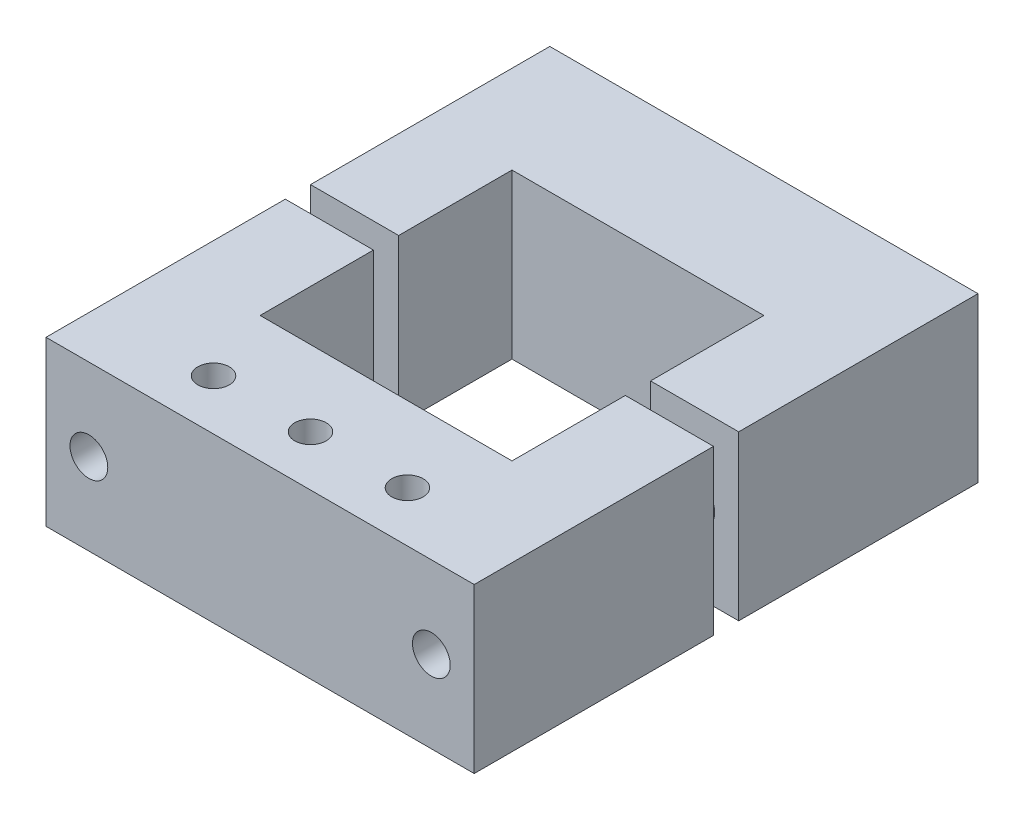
ISO-10303-21;
HEADER;
FILE_DESCRIPTION(('STEP AP214'),'2;1');
FILE_NAME('part.step','',(''),(''),'','','');
FILE_SCHEMA(('AUTOMOTIVE_DESIGN { 1 0 10303 214 1 1 1 1 }'));
ENDSEC;
DATA;
#1=APPLICATION_CONTEXT('core data for automotive mechanical design processes');
#2=APPLICATION_PROTOCOL_DEFINITION('international standard','automotive_design',2000,#1);
#3=PRODUCT_CONTEXT('',#1,'mechanical');
#4=PRODUCT('Part','Part','',(#3));
#5=PRODUCT_RELATED_PRODUCT_CATEGORY('part','',(#4));
#6=PRODUCT_DEFINITION_FORMATION('','',#4);
#7=PRODUCT_DEFINITION_CONTEXT('part definition',#1,'design');
#8=PRODUCT_DEFINITION('design','',#6,#7);
#9=PRODUCT_DEFINITION_SHAPE('','',#8);
#10=(LENGTH_UNIT() NAMED_UNIT(*) SI_UNIT(.MILLI.,.METRE.));
#11=(NAMED_UNIT(*) PLANE_ANGLE_UNIT() SI_UNIT($,.RADIAN.));
#12=(NAMED_UNIT(*) SI_UNIT($,.STERADIAN.) SOLID_ANGLE_UNIT());
#13=UNCERTAINTY_MEASURE_WITH_UNIT(LENGTH_MEASURE(1.E-05),#10,'distance_accuracy_value','');
#14=(GEOMETRIC_REPRESENTATION_CONTEXT(3) GLOBAL_UNCERTAINTY_ASSIGNED_CONTEXT((#13)) GLOBAL_UNIT_ASSIGNED_CONTEXT((#10,
#11,#12)) REPRESENTATION_CONTEXT('',''));
#15=CARTESIAN_POINT('',(0.,0.,0.));
#16=DIRECTION('',(0.,0.,1.));
#17=DIRECTION('',(1.,0.,0.));
#18=AXIS2_PLACEMENT_3D('',#15,#16,#17);
#19=CARTESIAN_POINT('',(244.342156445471,-136.058532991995,-30.));
#20=DIRECTION('',(1.,0.,0.));
#21=DIRECTION('',(0.,0.,-1.));
#22=AXIS2_PLACEMENT_3D('',#19,#20,#21);
#23=PLANE('',#22);
#24=DIRECTION('',(0.,1.,0.));
#25=VECTOR('',#24,1.);
#26=CARTESIAN_POINT('',(244.342156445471,-156.058532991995,-11.));
#27=LINE('',#26,#25);
#28=CARTESIAN_POINT('',(244.342156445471,-149.058532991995,-11.));
#29=VERTEX_POINT('',#28);
#30=CARTESIAN_POINT('',(244.342156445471,-136.058532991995,-11.));
#31=VERTEX_POINT('',#30);
#32=EDGE_CURVE('E165',#29,#31,#27,.T.);
#33=ORIENTED_EDGE('',*,*,#32,.F.);
#34=DIRECTION('',(0.,0.,1.));
#35=VECTOR('',#34,1.);
#36=CARTESIAN_POINT('',(244.342156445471,-149.058532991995,-30.));
#37=LINE('',#36,#35);
#38=CARTESIAN_POINT('',(244.342156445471,-149.058532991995,-30.));
#39=VERTEX_POINT('',#38);
#40=EDGE_CURVE('E139',#39,#29,#37,.T.);
#41=ORIENTED_EDGE('',*,*,#40,.F.);
#42=DIRECTION('',(0.,1.,0.));
#43=VECTOR('',#42,1.);
#44=CARTESIAN_POINT('',(244.342156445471,-136.058532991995,-30.));
#45=LINE('',#44,#43);
#46=CARTESIAN_POINT('',(244.342156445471,-136.058532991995,-30.));
#47=VERTEX_POINT('',#46);
#48=EDGE_CURVE('E138',#39,#47,#45,.T.);
#49=ORIENTED_EDGE('',*,*,#48,.T.);
#50=DIRECTION('',(0.,0.,1.));
#51=VECTOR('',#50,1.);
#52=CARTESIAN_POINT('',(244.342156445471,-136.058532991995,-30.));
#53=LINE('',#52,#51);
#54=EDGE_CURVE('E135',#47,#31,#53,.T.);
#55=ORIENTED_EDGE('',*,*,#54,.T.);
#56=EDGE_LOOP('',(#33,#41,#49,#55));
#57=FACE_BOUND('',#56,.T.);
#58=ADVANCED_FACE('F42',(#57),#23,.T.);
#59=CARTESIAN_POINT('',(240.938339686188,-142.558532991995,-30.));
#60=DIRECTION('',(0.,0.,1.));
#61=DIRECTION('',(1.,0.,0.));
#62=AXIS2_PLACEMENT_3D('',#59,#60,#61);
#63=CYLINDRICAL_SURFACE('',#62,1.5);
#64=CARTESIAN_POINT('',(240.938339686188,-142.558532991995,-11.));
#65=DIRECTION('',(0.,0.,-1.));
#66=DIRECTION('',(-1.,0.,0.));
#67=AXIS2_PLACEMENT_3D('',#64,#65,#66);
#68=CIRCLE('',#67,1.5);
#69=CARTESIAN_POINT('',(239.438339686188,-142.558532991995,-11.));
#70=VERTEX_POINT('',#69);
#71=EDGE_CURVE('E137',#70,#70,#68,.F.);
#72=ORIENTED_EDGE('',*,*,#71,.T.);
#73=EDGE_LOOP('',(#72));
#74=FACE_BOUND('',#73,.T.);
#75=CARTESIAN_POINT('',(240.938339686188,-142.558532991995,-30.));
#76=DIRECTION('',(0.,0.,1.));
#77=DIRECTION('',(-1.,0.,0.));
#78=AXIS2_PLACEMENT_3D('',#75,#76,#77);
#79=CIRCLE('',#78,1.5);
#80=CARTESIAN_POINT('',(239.438339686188,-142.558532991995,-30.));
#81=VERTEX_POINT('',#80);
#82=EDGE_CURVE('E141',#81,#81,#79,.T.);
#83=ORIENTED_EDGE('',*,*,#82,.F.);
#84=EDGE_LOOP('',(#83));
#85=FACE_BOUND('',#84,.T.);
#86=ADVANCED_FACE('F44',(#74,#85),#63,.F.);
#87=CARTESIAN_POINT('',(210.342156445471,-149.058532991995,-30.));
#88=DIRECTION('',(-1.,0.,0.));
#89=DIRECTION('',(0.,0.,1.));
#90=AXIS2_PLACEMENT_3D('',#87,#88,#89);
#91=PLANE('',#90);
#92=DIRECTION('',(0.,1.,0.));
#93=VECTOR('',#92,1.);
#94=CARTESIAN_POINT('',(210.342156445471,-156.058532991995,-11.));
#95=LINE('',#94,#93);
#96=CARTESIAN_POINT('',(210.342156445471,-149.058532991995,-11.));
#97=VERTEX_POINT('',#96);
#98=CARTESIAN_POINT('',(210.342156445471,-136.058532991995,-11.));
#99=VERTEX_POINT('',#98);
#100=EDGE_CURVE('E156',#97,#99,#95,.T.);
#101=ORIENTED_EDGE('',*,*,#100,.T.);
#102=DIRECTION('',(0.,0.,1.));
#103=VECTOR('',#102,1.);
#104=CARTESIAN_POINT('',(210.342156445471,-136.058532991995,-30.));
#105=LINE('',#104,#103);
#106=CARTESIAN_POINT('',(210.342156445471,-136.058532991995,-30.));
#107=VERTEX_POINT('',#106);
#108=EDGE_CURVE('E131',#107,#99,#105,.T.);
#109=ORIENTED_EDGE('',*,*,#108,.F.);
#110=DIRECTION('',(0.,-1.,0.));
#111=VECTOR('',#110,1.);
#112=CARTESIAN_POINT('',(210.342156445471,-149.058532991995,-30.));
#113=LINE('',#112,#111);
#114=CARTESIAN_POINT('',(210.342156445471,-149.058532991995,-30.));
#115=VERTEX_POINT('',#114);
#116=EDGE_CURVE('E153',#107,#115,#113,.T.);
#117=ORIENTED_EDGE('',*,*,#116,.T.);
#118=DIRECTION('',(0.,0.,1.));
#119=VECTOR('',#118,1.);
#120=CARTESIAN_POINT('',(210.342156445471,-149.058532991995,-30.));
#121=LINE('',#120,#119);
#122=EDGE_CURVE('E46',#115,#97,#121,.T.);
#123=ORIENTED_EDGE('',*,*,#122,.T.);
#124=EDGE_LOOP('',(#101,#109,#117,#123));
#125=FACE_BOUND('',#124,.T.);
#126=ADVANCED_FACE('F188',(#125),#91,.T.);
#127=CARTESIAN_POINT('',(210.342156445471,-136.058532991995,-30.));
#128=DIRECTION('',(0.,1.,0.));
#129=DIRECTION('',(0.,0.,1.));
#130=AXIS2_PLACEMENT_3D('',#127,#128,#129);
#131=PLANE('',#130);
#132=DIRECTION('',(-1.,0.,0.));
#133=VECTOR('',#132,1.);
#134=CARTESIAN_POINT('',(237.342156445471,-136.058532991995,-11.));
#135=LINE('',#134,#133);
#136=CARTESIAN_POINT('',(237.342156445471,-136.058532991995,-11.));
#137=VERTEX_POINT('',#136);
#138=EDGE_CURVE('E171',#31,#137,#135,.T.);
#139=ORIENTED_EDGE('',*,*,#138,.F.);
#140=ORIENTED_EDGE('',*,*,#54,.F.);
#141=DIRECTION('',(-1.,0.,0.));
#142=VECTOR('',#141,1.);
#143=CARTESIAN_POINT('',(210.342156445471,-136.058532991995,-30.));
#144=LINE('',#143,#142);
#145=EDGE_CURVE('E134',#47,#107,#144,.T.);
#146=ORIENTED_EDGE('',*,*,#145,.T.);
#147=ORIENTED_EDGE('',*,*,#108,.T.);
#148=DIRECTION('',(-1.,0.,0.));
#149=VECTOR('',#148,1.);
#150=CARTESIAN_POINT('',(217.342156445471,-136.058532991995,-11.));
#151=LINE('',#150,#149);
#152=CARTESIAN_POINT('',(217.342156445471,-136.058532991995,-11.));
#153=VERTEX_POINT('',#152);
#154=EDGE_CURVE('E121',#153,#99,#151,.T.);
#155=ORIENTED_EDGE('',*,*,#154,.F.);
#156=DIRECTION('',(0.,0.,1.));
#157=VECTOR('',#156,1.);
#158=CARTESIAN_POINT('',(217.342156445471,-136.058532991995,-20.));
#159=LINE('',#158,#157);
#160=CARTESIAN_POINT('',(217.342156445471,-136.058532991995,-20.));
#161=VERTEX_POINT('',#160);
#162=EDGE_CURVE('E106',#161,#153,#159,.T.);
#163=ORIENTED_EDGE('',*,*,#162,.F.);
#164=DIRECTION('',(-1.,0.,0.));
#165=VECTOR('',#164,1.);
#166=CARTESIAN_POINT('',(237.342156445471,-136.058532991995,-20.));
#167=LINE('',#166,#165);
#168=CARTESIAN_POINT('',(237.342156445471,-136.058532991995,-20.));
#169=VERTEX_POINT('',#168);
#170=EDGE_CURVE('E12',#169,#161,#167,.T.);
#171=ORIENTED_EDGE('',*,*,#170,.F.);
#172=DIRECTION('',(0.,0.,-1.));
#173=VECTOR('',#172,1.);
#174=CARTESIAN_POINT('',(237.342156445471,-136.058532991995,-11.));
#175=LINE('',#174,#173);
#176=EDGE_CURVE('E128',#137,#169,#175,.T.);
#177=ORIENTED_EDGE('',*,*,#176,.F.);
#178=EDGE_LOOP('',(#139,#140,#146,#147,#155,#163,#171,#177));
#179=FACE_BOUND('',#178,.T.);
#180=ADVANCED_FACE('F119',(#179),#131,.T.);
#181=CARTESIAN_POINT('',(244.342156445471,-149.058532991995,-30.));
#182=DIRECTION('',(0.,-1.,0.));
#183=DIRECTION('',(0.,0.,-1.));
#184=AXIS2_PLACEMENT_3D('',#181,#182,#183);
#185=PLANE('',#184);
#186=DIRECTION('',(1.,0.,0.));
#187=VECTOR('',#186,1.);
#188=CARTESIAN_POINT('',(244.342156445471,-149.058532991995,-11.));
#189=LINE('',#188,#187);
#190=CARTESIAN_POINT('',(237.342156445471,-149.058532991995,-11.));
#191=VERTEX_POINT('',#190);
#192=EDGE_CURVE('E163',#191,#29,#189,.T.);
#193=ORIENTED_EDGE('',*,*,#192,.F.);
#194=DIRECTION('',(0.,0.,1.));
#195=VECTOR('',#194,1.);
#196=CARTESIAN_POINT('',(237.342156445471,-149.058532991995,-30.));
#197=LINE('',#196,#195);
#198=CARTESIAN_POINT('',(237.342156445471,-149.058532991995,-20.));
#199=VERTEX_POINT('',#198);
#200=EDGE_CURVE('E172',#199,#191,#197,.T.);
#201=ORIENTED_EDGE('',*,*,#200,.F.);
#202=DIRECTION('',(1.,0.,0.));
#203=VECTOR('',#202,1.);
#204=CARTESIAN_POINT('',(244.342156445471,-149.058532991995,-20.));
#205=LINE('',#204,#203);
#206=CARTESIAN_POINT('',(217.342156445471,-149.058532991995,-20.));
#207=VERTEX_POINT('',#206);
#208=EDGE_CURVE('E122',#207,#199,#205,.T.);
#209=ORIENTED_EDGE('',*,*,#208,.F.);
#210=DIRECTION('',(0.,0.,-1.));
#211=VECTOR('',#210,1.);
#212=CARTESIAN_POINT('',(217.342156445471,-149.058532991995,-30.));
#213=LINE('',#212,#211);
#214=CARTESIAN_POINT('',(217.342156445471,-149.058532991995,-11.));
#215=VERTEX_POINT('',#214);
#216=EDGE_CURVE('E109',#215,#207,#213,.T.);
#217=ORIENTED_EDGE('',*,*,#216,.F.);
#218=DIRECTION('',(1.,0.,0.));
#219=VECTOR('',#218,1.);
#220=CARTESIAN_POINT('',(244.342156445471,-149.058532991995,-11.));
#221=LINE('',#220,#219);
#222=EDGE_CURVE('E160',#97,#215,#221,.T.);
#223=ORIENTED_EDGE('',*,*,#222,.F.);
#224=ORIENTED_EDGE('',*,*,#122,.F.);
#225=DIRECTION('',(1.,0.,0.));
#226=VECTOR('',#225,1.);
#227=CARTESIAN_POINT('',(244.342156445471,-149.058532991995,-30.));
#228=LINE('',#227,#226);
#229=EDGE_CURVE('E133',#115,#39,#228,.T.);
#230=ORIENTED_EDGE('',*,*,#229,.T.);
#231=ORIENTED_EDGE('',*,*,#40,.T.);
#232=EDGE_LOOP('',(#193,#201,#209,#217,#223,#224,#230,#231));
#233=FACE_BOUND('',#232,.T.);
#234=ADVANCED_FACE('F191',(#233),#185,.T.);
#235=CARTESIAN_POINT('',(210.342156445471,-136.058532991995,-30.));
#236=DIRECTION('',(0.,0.,-1.));
#237=DIRECTION('',(-1.,0.,0.));
#238=AXIS2_PLACEMENT_3D('',#235,#236,#237);
#239=PLANE('',#238);
#240=ORIENTED_EDGE('',*,*,#82,.T.);
#241=EDGE_LOOP('',(#240));
#242=FACE_BOUND('',#241,.T.);
#243=CARTESIAN_POINT('',(213.745973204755,-142.558532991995,-30.));
#244=DIRECTION('',(0.,0.,1.));
#245=DIRECTION('',(1.,0.,0.));
#246=AXIS2_PLACEMENT_3D('',#243,#244,#245);
#247=CIRCLE('',#246,1.5);
#248=CARTESIAN_POINT('',(215.245973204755,-142.558532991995,-30.));
#249=VERTEX_POINT('',#248);
#250=EDGE_CURVE('E146',#249,#249,#247,.T.);
#251=ORIENTED_EDGE('',*,*,#250,.T.);
#252=EDGE_LOOP('',(#251));
#253=FACE_BOUND('',#252,.T.);
#254=ORIENTED_EDGE('',*,*,#116,.F.);
#255=ORIENTED_EDGE('',*,*,#145,.F.);
#256=ORIENTED_EDGE('',*,*,#48,.F.);
#257=ORIENTED_EDGE('',*,*,#229,.F.);
#258=EDGE_LOOP('',(#254,#255,#256,#257));
#259=FACE_BOUND('',#258,.T.);
#260=ADVANCED_FACE('F194',(#242,#253,#259),#239,.T.);
#261=CARTESIAN_POINT('',(213.745973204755,-142.558532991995,-30.));
#262=DIRECTION('',(0.,0.,1.));
#263=DIRECTION('',(1.,0.,0.));
#264=AXIS2_PLACEMENT_3D('',#261,#262,#263);
#265=CYLINDRICAL_SURFACE('',#264,1.5);
#266=CARTESIAN_POINT('',(213.745973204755,-142.558532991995,-11.));
#267=DIRECTION('',(0.,0.,-1.));
#268=DIRECTION('',(-1.,0.,0.));
#269=AXIS2_PLACEMENT_3D('',#266,#267,#268);
#270=CIRCLE('',#269,1.5);
#271=CARTESIAN_POINT('',(212.245973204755,-142.558532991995,-11.));
#272=VERTEX_POINT('',#271);
#273=EDGE_CURVE('E158',#272,#272,#270,.F.);
#274=ORIENTED_EDGE('',*,*,#273,.T.);
#275=EDGE_LOOP('',(#274));
#276=FACE_BOUND('',#275,.T.);
#277=ORIENTED_EDGE('',*,*,#250,.F.);
#278=EDGE_LOOP('',(#277));
#279=FACE_BOUND('',#278,.T.);
#280=ADVANCED_FACE('F223',(#276,#279),#265,.F.);
#281=CARTESIAN_POINT('',(217.342156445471,-156.058532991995,-11.));
#282=DIRECTION('',(0.,0.,-1.));
#283=DIRECTION('',(-1.,0.,0.));
#284=AXIS2_PLACEMENT_3D('',#281,#282,#283);
#285=PLANE('',#284);
#286=ORIENTED_EDGE('',*,*,#222,.T.);
#287=DIRECTION('',(0.,1.,0.));
#288=VECTOR('',#287,1.);
#289=CARTESIAN_POINT('',(217.342156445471,-156.058532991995,-11.));
#290=LINE('',#289,#288);
#291=EDGE_CURVE('E162',#215,#153,#290,.T.);
#292=ORIENTED_EDGE('',*,*,#291,.T.);
#293=ORIENTED_EDGE('',*,*,#154,.T.);
#294=ORIENTED_EDGE('',*,*,#100,.F.);
#295=EDGE_LOOP('',(#286,#292,#293,#294));
#296=FACE_BOUND('',#295,.T.);
#297=ORIENTED_EDGE('',*,*,#273,.F.);
#298=EDGE_LOOP('',(#297));
#299=FACE_BOUND('',#298,.T.);
#300=ADVANCED_FACE('F208',(#296,#299),#285,.F.);
#301=CARTESIAN_POINT('',(237.342156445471,-156.058532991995,-11.));
#302=DIRECTION('',(0.,0.,-1.));
#303=DIRECTION('',(-1.,0.,0.));
#304=AXIS2_PLACEMENT_3D('',#301,#302,#303);
#305=PLANE('',#304);
#306=ORIENTED_EDGE('',*,*,#192,.T.);
#307=ORIENTED_EDGE('',*,*,#32,.T.);
#308=ORIENTED_EDGE('',*,*,#138,.T.);
#309=DIRECTION('',(0.,1.,0.));
#310=VECTOR('',#309,1.);
#311=CARTESIAN_POINT('',(237.342156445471,-156.058532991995,-11.));
#312=LINE('',#311,#310);
#313=EDGE_CURVE('E130',#191,#137,#312,.T.);
#314=ORIENTED_EDGE('',*,*,#313,.F.);
#315=EDGE_LOOP('',(#306,#307,#308,#314));
#316=FACE_BOUND('',#315,.T.);
#317=ORIENTED_EDGE('',*,*,#71,.F.);
#318=EDGE_LOOP('',(#317));
#319=FACE_BOUND('',#318,.T.);
#320=ADVANCED_FACE('F198',(#316,#319),#305,.F.);
#321=CARTESIAN_POINT('',(237.342156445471,-156.058532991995,-11.));
#322=DIRECTION('',(1.,0.,0.));
#323=DIRECTION('',(0.,0.,-1.));
#324=AXIS2_PLACEMENT_3D('',#321,#322,#323);
#325=PLANE('',#324);
#326=ORIENTED_EDGE('',*,*,#200,.T.);
#327=ORIENTED_EDGE('',*,*,#313,.T.);
#328=ORIENTED_EDGE('',*,*,#176,.T.);
#329=DIRECTION('',(0.,1.,0.));
#330=VECTOR('',#329,1.);
#331=CARTESIAN_POINT('',(237.342156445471,-156.058532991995,-20.));
#332=LINE('',#331,#330);
#333=EDGE_CURVE('E52',#199,#169,#332,.T.);
#334=ORIENTED_EDGE('',*,*,#333,.F.);
#335=EDGE_LOOP('',(#326,#327,#328,#334));
#336=FACE_BOUND('',#335,.T.);
#337=ADVANCED_FACE('F200',(#336),#325,.F.);
#338=CARTESIAN_POINT('',(217.342156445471,-156.058532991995,-20.));
#339=DIRECTION('',(-1.,0.,0.));
#340=DIRECTION('',(0.,0.,1.));
#341=AXIS2_PLACEMENT_3D('',#338,#339,#340);
#342=PLANE('',#341);
#343=ORIENTED_EDGE('',*,*,#216,.T.);
#344=DIRECTION('',(0.,1.,0.));
#345=VECTOR('',#344,1.);
#346=CARTESIAN_POINT('',(217.342156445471,-156.058532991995,-20.));
#347=LINE('',#346,#345);
#348=EDGE_CURVE('E59',#207,#161,#347,.T.);
#349=ORIENTED_EDGE('',*,*,#348,.T.);
#350=ORIENTED_EDGE('',*,*,#162,.T.);
#351=ORIENTED_EDGE('',*,*,#291,.F.);
#352=EDGE_LOOP('',(#343,#349,#350,#351));
#353=FACE_BOUND('',#352,.T.);
#354=ADVANCED_FACE('F103',(#353),#342,.F.);
#355=CARTESIAN_POINT('',(237.342156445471,-156.058532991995,-20.));
#356=DIRECTION('',(0.,0.,-1.));
#357=DIRECTION('',(-1.,0.,0.));
#358=AXIS2_PLACEMENT_3D('',#355,#356,#357);
#359=PLANE('',#358);
#360=ORIENTED_EDGE('',*,*,#208,.T.);
#361=ORIENTED_EDGE('',*,*,#333,.T.);
#362=ORIENTED_EDGE('',*,*,#170,.T.);
#363=ORIENTED_EDGE('',*,*,#348,.F.);
#364=EDGE_LOOP('',(#360,#361,#362,#363));
#365=FACE_BOUND('',#364,.T.);
#366=ADVANCED_FACE('F113',(#365),#359,.F.);
#367=CLOSED_SHELL('',(#58,#86,#126,#180,#234,#260,#280,#300,#320,#337,#354,#366));
#368=MANIFOLD_SOLID_BREP('B2',#367);
#369=CARTESIAN_POINT('',(244.342156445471,-149.058532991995,-30.));
#370=DIRECTION('',(0.,-1.,0.));
#371=DIRECTION('',(0.,0.,-1.));
#372=AXIS2_PLACEMENT_3D('',#369,#370,#371);
#373=PLANE('',#372);
#374=CARTESIAN_POINT('',(219.644215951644,-149.058532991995,5.99999999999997));
#375=DIRECTION('',(0.,-1.,0.));
#376=DIRECTION('',(0.,0.,-1.));
#377=AXIS2_PLACEMENT_3D('',#374,#375,#376);
#378=CIRCLE('',#377,1.25000000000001);
#379=CARTESIAN_POINT('',(219.644215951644,-149.058532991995,4.74999999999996));
#380=VERTEX_POINT('',#379);
#381=EDGE_CURVE('E484',#380,#380,#378,.T.);
#382=ORIENTED_EDGE('',*,*,#381,.F.);
#383=EDGE_LOOP('',(#382));
#384=FACE_BOUND('',#383,.T.);
#385=CARTESIAN_POINT('',(227.342156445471,-149.058532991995,5.99999999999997));
#386=DIRECTION('',(0.,-1.,0.));
#387=DIRECTION('',(0.,0.,-1.));
#388=AXIS2_PLACEMENT_3D('',#385,#386,#387);
#389=CIRCLE('',#388,1.25000000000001);
#390=CARTESIAN_POINT('',(227.342156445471,-149.058532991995,4.74999999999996));
#391=VERTEX_POINT('',#390);
#392=EDGE_CURVE('E478',#391,#391,#389,.T.);
#393=ORIENTED_EDGE('',*,*,#392,.F.);
#394=EDGE_LOOP('',(#393));
#395=FACE_BOUND('',#394,.T.);
#396=CARTESIAN_POINT('',(235.040096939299,-149.058532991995,6.00000000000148));
#397=DIRECTION('',(0.,-1.,0.));
#398=DIRECTION('',(0.,0.,-1.));
#399=AXIS2_PLACEMENT_3D('',#396,#397,#398);
#400=CIRCLE('',#399,1.25000000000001);
#401=CARTESIAN_POINT('',(235.040096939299,-149.058532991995,4.75000000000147));
#402=VERTEX_POINT('',#401);
#403=EDGE_CURVE('E391',#402,#402,#400,.T.);
#404=ORIENTED_EDGE('',*,*,#403,.F.);
#405=EDGE_LOOP('',(#404));
#406=FACE_BOUND('',#405,.T.);
#407=DIRECTION('',(-1.,0.,0.));
#408=VECTOR('',#407,1.);
#409=CARTESIAN_POINT('',(244.342156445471,-149.058532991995,-9.00000000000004));
#410=LINE('',#409,#408);
#411=CARTESIAN_POINT('',(244.342156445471,-149.058532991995,-9.00000000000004));
#412=VERTEX_POINT('',#411);
#413=CARTESIAN_POINT('',(237.342156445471,-149.058532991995,-9.00000000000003));
#414=VERTEX_POINT('',#413);
#415=EDGE_CURVE('E412',#412,#414,#410,.T.);
#416=ORIENTED_EDGE('',*,*,#415,.F.);
#417=DIRECTION('',(0.,0.,1.));
#418=VECTOR('',#417,1.);
#419=CARTESIAN_POINT('',(244.342156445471,-149.058532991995,-30.));
#420=LINE('',#419,#418);
#421=CARTESIAN_POINT('',(244.342156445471,-149.058532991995,10.));
#422=VERTEX_POINT('',#421);
#423=EDGE_CURVE('E400',#412,#422,#420,.T.);
#424=ORIENTED_EDGE('',*,*,#423,.T.);
#425=DIRECTION('',(1.,0.,0.));
#426=VECTOR('',#425,1.);
#427=CARTESIAN_POINT('',(244.342156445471,-149.058532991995,10.));
#428=LINE('',#427,#426);
#429=CARTESIAN_POINT('',(210.342156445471,-149.058532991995,10.));
#430=VERTEX_POINT('',#429);
#431=EDGE_CURVE('E442',#430,#422,#428,.T.);
#432=ORIENTED_EDGE('',*,*,#431,.F.);
#433=DIRECTION('',(0.,0.,1.));
#434=VECTOR('',#433,1.);
#435=CARTESIAN_POINT('',(210.342156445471,-149.058532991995,-30.));
#436=LINE('',#435,#434);
#437=CARTESIAN_POINT('',(210.342156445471,-149.058532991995,-9.00000000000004));
#438=VERTEX_POINT('',#437);
#439=EDGE_CURVE('E407',#438,#430,#436,.T.);
#440=ORIENTED_EDGE('',*,*,#439,.F.);
#441=DIRECTION('',(-1.,0.,0.));
#442=VECTOR('',#441,1.);
#443=CARTESIAN_POINT('',(244.342156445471,-149.058532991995,-9.00000000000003));
#444=LINE('',#443,#442);
#445=CARTESIAN_POINT('',(217.342156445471,-149.058532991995,-9.00000000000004));
#446=VERTEX_POINT('',#445);
#447=EDGE_CURVE('E381',#446,#438,#444,.T.);
#448=ORIENTED_EDGE('',*,*,#447,.F.);
#449=DIRECTION('',(0.,0.,-1.));
#450=VECTOR('',#449,1.);
#451=CARTESIAN_POINT('',(217.342156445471,-149.058532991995,-30.));
#452=LINE('',#451,#450);
#453=CARTESIAN_POINT('',(217.342156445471,-149.058532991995,0.));
#454=VERTEX_POINT('',#453);
#455=EDGE_CURVE('E396',#454,#446,#452,.T.);
#456=ORIENTED_EDGE('',*,*,#455,.F.);
#457=DIRECTION('',(-1.,0.,0.));
#458=VECTOR('',#457,1.);
#459=CARTESIAN_POINT('',(244.342156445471,-149.058532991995,0.));
#460=LINE('',#459,#458);
#461=CARTESIAN_POINT('',(237.342156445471,-149.058532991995,0.));
#462=VERTEX_POINT('',#461);
#463=EDGE_CURVE('E319',#462,#454,#460,.T.);
#464=ORIENTED_EDGE('',*,*,#463,.F.);
#465=DIRECTION('',(0.,0.,1.));
#466=VECTOR('',#465,1.);
#467=CARTESIAN_POINT('',(237.342156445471,-149.058532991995,-30.));
#468=LINE('',#467,#466);
#469=EDGE_CURVE('E40',#414,#462,#468,.T.);
#470=ORIENTED_EDGE('',*,*,#469,.F.);
#471=EDGE_LOOP('',(#416,#424,#432,#440,#448,#456,#464,#470));
#472=FACE_BOUND('',#471,.T.);
#473=ADVANCED_FACE('F311',(#384,#395,#406,#472),#373,.T.);
#474=CARTESIAN_POINT('',(244.342156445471,-136.058532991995,-30.));
#475=DIRECTION('',(1.,0.,0.));
#476=DIRECTION('',(0.,0.,-1.));
#477=AXIS2_PLACEMENT_3D('',#474,#475,#476);
#478=PLANE('',#477);
#479=DIRECTION('',(0.,1.,0.));
#480=VECTOR('',#479,1.);
#481=CARTESIAN_POINT('',(244.342156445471,-156.058532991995,-9.00000000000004));
#482=LINE('',#481,#480);
#483=CARTESIAN_POINT('',(244.342156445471,-136.058532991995,-9.00000000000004));
#484=VERTEX_POINT('',#483);
#485=EDGE_CURVE('E413',#412,#484,#482,.T.);
#486=ORIENTED_EDGE('',*,*,#485,.T.);
#487=DIRECTION('',(0.,0.,1.));
#488=VECTOR('',#487,1.);
#489=CARTESIAN_POINT('',(244.342156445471,-136.058532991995,-30.));
#490=LINE('',#489,#488);
#491=CARTESIAN_POINT('',(244.342156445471,-136.058532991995,10.));
#492=VERTEX_POINT('',#491);
#493=EDGE_CURVE('E397',#484,#492,#490,.T.);
#494=ORIENTED_EDGE('',*,*,#493,.T.);
#495=DIRECTION('',(0.,1.,0.));
#496=VECTOR('',#495,1.);
#497=CARTESIAN_POINT('',(244.342156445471,-136.058532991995,10.));
#498=LINE('',#497,#496);
#499=EDGE_CURVE('E444',#422,#492,#498,.T.);
#500=ORIENTED_EDGE('',*,*,#499,.F.);
#501=ORIENTED_EDGE('',*,*,#423,.F.);
#502=EDGE_LOOP('',(#486,#494,#500,#501));
#503=FACE_BOUND('',#502,.T.);
#504=ADVANCED_FACE('F454',(#503),#478,.T.);
#505=CARTESIAN_POINT('',(210.342156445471,-136.058532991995,-30.));
#506=DIRECTION('',(0.,1.,0.));
#507=DIRECTION('',(0.,0.,1.));
#508=AXIS2_PLACEMENT_3D('',#505,#506,#507);
#509=PLANE('',#508);
#510=CARTESIAN_POINT('',(219.644215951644,-136.058532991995,5.99999999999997));
#511=DIRECTION('',(0.,1.,0.));
#512=DIRECTION('',(0.,0.,1.));
#513=AXIS2_PLACEMENT_3D('',#510,#511,#512);
#514=CIRCLE('',#513,1.25000000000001);
#515=CARTESIAN_POINT('',(219.644215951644,-136.058532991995,7.24999999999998));
#516=VERTEX_POINT('',#515);
#517=EDGE_CURVE('E487',#516,#516,#514,.T.);
#518=ORIENTED_EDGE('',*,*,#517,.F.);
#519=EDGE_LOOP('',(#518));
#520=FACE_BOUND('',#519,.T.);
#521=CARTESIAN_POINT('',(227.342156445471,-136.058532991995,5.99999999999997));
#522=DIRECTION('',(0.,1.,0.));
#523=DIRECTION('',(0.,0.,1.));
#524=AXIS2_PLACEMENT_3D('',#521,#522,#523);
#525=CIRCLE('',#524,1.25000000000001);
#526=CARTESIAN_POINT('',(227.342156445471,-136.058532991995,7.24999999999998));
#527=VERTEX_POINT('',#526);
#528=EDGE_CURVE('E481',#527,#527,#525,.T.);
#529=ORIENTED_EDGE('',*,*,#528,.F.);
#530=EDGE_LOOP('',(#529));
#531=FACE_BOUND('',#530,.T.);
#532=CARTESIAN_POINT('',(235.040096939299,-136.058532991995,6.00000000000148));
#533=DIRECTION('',(0.,1.,0.));
#534=DIRECTION('',(0.,0.,1.));
#535=AXIS2_PLACEMENT_3D('',#532,#533,#534);
#536=CIRCLE('',#535,1.25000000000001);
#537=CARTESIAN_POINT('',(235.040096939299,-136.058532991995,7.25000000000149));
#538=VERTEX_POINT('',#537);
#539=EDGE_CURVE('E475',#538,#538,#536,.T.);
#540=ORIENTED_EDGE('',*,*,#539,.F.);
#541=EDGE_LOOP('',(#540));
#542=FACE_BOUND('',#541,.T.);
#543=DIRECTION('',(1.,0.,0.));
#544=VECTOR('',#543,1.);
#545=CARTESIAN_POINT('',(244.342156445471,-136.058532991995,-9.00000000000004));
#546=LINE('',#545,#544);
#547=CARTESIAN_POINT('',(237.342156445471,-136.058532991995,-9.00000000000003));
#548=VERTEX_POINT('',#547);
#549=EDGE_CURVE('E384',#548,#484,#546,.T.);
#550=ORIENTED_EDGE('',*,*,#549,.F.);
#551=DIRECTION('',(0.,0.,-1.));
#552=VECTOR('',#551,1.);
#553=CARTESIAN_POINT('',(237.342156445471,-136.058532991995,0.));
#554=LINE('',#553,#552);
#555=CARTESIAN_POINT('',(237.342156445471,-136.058532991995,0.));
#556=VERTEX_POINT('',#555);
#557=EDGE_CURVE('E468',#556,#548,#554,.T.);
#558=ORIENTED_EDGE('',*,*,#557,.F.);
#559=DIRECTION('',(1.,0.,0.));
#560=VECTOR('',#559,1.);
#561=CARTESIAN_POINT('',(217.342156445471,-136.058532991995,0.));
#562=LINE('',#561,#560);
#563=CARTESIAN_POINT('',(217.342156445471,-136.058532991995,0.));
#564=VERTEX_POINT('',#563);
#565=EDGE_CURVE('E469',#564,#556,#562,.T.);
#566=ORIENTED_EDGE('',*,*,#565,.F.);
#567=DIRECTION('',(0.,0.,1.));
#568=VECTOR('',#567,1.);
#569=CARTESIAN_POINT('',(217.342156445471,-136.058532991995,-9.00000000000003));
#570=LINE('',#569,#568);
#571=CARTESIAN_POINT('',(217.342156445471,-136.058532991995,-9.00000000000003));
#572=VERTEX_POINT('',#571);
#573=EDGE_CURVE('E390',#572,#564,#570,.T.);
#574=ORIENTED_EDGE('',*,*,#573,.F.);
#575=DIRECTION('',(1.,0.,0.));
#576=VECTOR('',#575,1.);
#577=CARTESIAN_POINT('',(210.342156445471,-136.058532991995,-9.00000000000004));
#578=LINE('',#577,#576);
#579=CARTESIAN_POINT('',(210.342156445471,-136.058532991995,-9.00000000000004));
#580=VERTEX_POINT('',#579);
#581=EDGE_CURVE('E378',#580,#572,#578,.T.);
#582=ORIENTED_EDGE('',*,*,#581,.F.);
#583=DIRECTION('',(0.,0.,1.));
#584=VECTOR('',#583,1.);
#585=CARTESIAN_POINT('',(210.342156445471,-136.058532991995,-30.));
#586=LINE('',#585,#584);
#587=CARTESIAN_POINT('',(210.342156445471,-136.058532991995,10.));
#588=VERTEX_POINT('',#587);
#589=EDGE_CURVE('E334',#580,#588,#586,.T.);
#590=ORIENTED_EDGE('',*,*,#589,.T.);
#591=DIRECTION('',(-1.,0.,0.));
#592=VECTOR('',#591,1.);
#593=CARTESIAN_POINT('',(210.342156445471,-136.058532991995,10.));
#594=LINE('',#593,#592);
#595=EDGE_CURVE('E403',#492,#588,#594,.T.);
#596=ORIENTED_EDGE('',*,*,#595,.F.);
#597=ORIENTED_EDGE('',*,*,#493,.F.);
#598=EDGE_LOOP('',(#550,#558,#566,#574,#582,#590,#596,#597));
#599=FACE_BOUND('',#598,.T.);
#600=ADVANCED_FACE('F387',(#520,#531,#542,#599),#509,.T.);
#601=CARTESIAN_POINT('',(210.342156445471,-149.058532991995,-30.));
#602=DIRECTION('',(-1.,0.,0.));
#603=DIRECTION('',(0.,0.,1.));
#604=AXIS2_PLACEMENT_3D('',#601,#602,#603);
#605=PLANE('',#604);
#606=DIRECTION('',(0.,1.,0.));
#607=VECTOR('',#606,1.);
#608=CARTESIAN_POINT('',(210.342156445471,-156.058532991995,-9.00000000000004));
#609=LINE('',#608,#607);
#610=EDGE_CURVE('E375',#438,#580,#609,.T.);
#611=ORIENTED_EDGE('',*,*,#610,.F.);
#612=ORIENTED_EDGE('',*,*,#439,.T.);
#613=DIRECTION('',(0.,-1.,0.));
#614=VECTOR('',#613,1.);
#615=CARTESIAN_POINT('',(210.342156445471,-149.058532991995,10.));
#616=LINE('',#615,#614);
#617=EDGE_CURVE('E395',#588,#430,#616,.T.);
#618=ORIENTED_EDGE('',*,*,#617,.F.);
#619=ORIENTED_EDGE('',*,*,#589,.F.);
#620=EDGE_LOOP('',(#611,#612,#618,#619));
#621=FACE_BOUND('',#620,.T.);
#622=ADVANCED_FACE('F313',(#621),#605,.T.);
#623=CARTESIAN_POINT('',(213.745973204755,-142.558532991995,-30.));
#624=DIRECTION('',(0.,0.,1.));
#625=DIRECTION('',(1.,0.,0.));
#626=AXIS2_PLACEMENT_3D('',#623,#624,#625);
#627=CYLINDRICAL_SURFACE('',#626,1.5);
#628=CARTESIAN_POINT('',(213.745973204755,-142.558532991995,-9.00000000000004));
#629=DIRECTION('',(0.,0.,1.));
#630=DIRECTION('',(1.,0.,0.));
#631=AXIS2_PLACEMENT_3D('',#628,#629,#630);
#632=CIRCLE('',#631,1.5);
#633=CARTESIAN_POINT('',(215.245973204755,-142.558532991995,-9.00000000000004));
#634=VERTEX_POINT('',#633);
#635=EDGE_CURVE('E414',#634,#634,#632,.F.);
#636=ORIENTED_EDGE('',*,*,#635,.T.);
#637=EDGE_LOOP('',(#636));
#638=FACE_BOUND('',#637,.T.);
#639=CARTESIAN_POINT('',(213.745973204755,-142.558532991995,10.));
#640=DIRECTION('',(0.,0.,1.));
#641=DIRECTION('',(1.,0.,0.));
#642=AXIS2_PLACEMENT_3D('',#639,#640,#641);
#643=CIRCLE('',#642,1.5);
#644=CARTESIAN_POINT('',(215.245973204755,-142.558532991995,10.));
#645=VERTEX_POINT('',#644);
#646=EDGE_CURVE('E435',#645,#645,#643,.T.);
#647=ORIENTED_EDGE('',*,*,#646,.T.);
#648=EDGE_LOOP('',(#647));
#649=FACE_BOUND('',#648,.T.);
#650=ADVANCED_FACE('F523',(#638,#649),#627,.F.);
#651=CARTESIAN_POINT('',(210.342156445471,-136.058532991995,10.));
#652=DIRECTION('',(0.,0.,-1.));
#653=DIRECTION('',(-1.,0.,0.));
#654=AXIS2_PLACEMENT_3D('',#651,#652,#653);
#655=PLANE('',#654);
#656=ORIENTED_EDGE('',*,*,#646,.F.);
#657=EDGE_LOOP('',(#656));
#658=FACE_BOUND('',#657,.T.);
#659=ORIENTED_EDGE('',*,*,#617,.T.);
#660=ORIENTED_EDGE('',*,*,#431,.T.);
#661=ORIENTED_EDGE('',*,*,#499,.T.);
#662=ORIENTED_EDGE('',*,*,#595,.T.);
#663=EDGE_LOOP('',(#659,#660,#661,#662));
#664=FACE_BOUND('',#663,.T.);
#665=CARTESIAN_POINT('',(240.938339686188,-142.558532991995,10.));
#666=DIRECTION('',(0.,0.,1.));
#667=DIRECTION('',(-1.,0.,0.));
#668=AXIS2_PLACEMENT_3D('',#665,#666,#667);
#669=CIRCLE('',#668,1.5);
#670=CARTESIAN_POINT('',(239.438339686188,-142.558532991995,10.));
#671=VERTEX_POINT('',#670);
#672=EDGE_CURVE('E432',#671,#671,#669,.T.);
#673=ORIENTED_EDGE('',*,*,#672,.F.);
#674=EDGE_LOOP('',(#673));
#675=FACE_BOUND('',#674,.T.);
#676=ADVANCED_FACE('F448',(#658,#664,#675),#655,.F.);
#677=CARTESIAN_POINT('',(240.938339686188,-142.558532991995,-30.));
#678=DIRECTION('',(0.,0.,1.));
#679=DIRECTION('',(1.,0.,0.));
#680=AXIS2_PLACEMENT_3D('',#677,#678,#679);
#681=CYLINDRICAL_SURFACE('',#680,1.5);
#682=CARTESIAN_POINT('',(240.938339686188,-142.558532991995,-9.00000000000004));
#683=DIRECTION('',(0.,0.,1.));
#684=DIRECTION('',(1.,0.,0.));
#685=AXIS2_PLACEMENT_3D('',#682,#683,#684);
#686=CIRCLE('',#685,1.5);
#687=CARTESIAN_POINT('',(242.438339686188,-142.558532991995,-9.00000000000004));
#688=VERTEX_POINT('',#687);
#689=EDGE_CURVE('E409',#688,#688,#686,.F.);
#690=ORIENTED_EDGE('',*,*,#689,.T.);
#691=EDGE_LOOP('',(#690));
#692=FACE_BOUND('',#691,.T.);
#693=ORIENTED_EDGE('',*,*,#672,.T.);
#694=EDGE_LOOP('',(#693));
#695=FACE_BOUND('',#694,.T.);
#696=ADVANCED_FACE('F527',(#692,#695),#681,.F.);
#697=CARTESIAN_POINT('',(210.342156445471,-156.058532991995,-9.00000000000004));
#698=DIRECTION('',(0.,0.,1.));
#699=DIRECTION('',(1.,0.,0.));
#700=AXIS2_PLACEMENT_3D('',#697,#698,#699);
#701=PLANE('',#700);
#702=ORIENTED_EDGE('',*,*,#447,.T.);
#703=ORIENTED_EDGE('',*,*,#610,.T.);
#704=ORIENTED_EDGE('',*,*,#581,.T.);
#705=DIRECTION('',(0.,1.,0.));
#706=VECTOR('',#705,1.);
#707=CARTESIAN_POINT('',(217.342156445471,-156.058532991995,-9.00000000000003));
#708=LINE('',#707,#706);
#709=EDGE_CURVE('E326',#446,#572,#708,.T.);
#710=ORIENTED_EDGE('',*,*,#709,.F.);
#711=EDGE_LOOP('',(#702,#703,#704,#710));
#712=FACE_BOUND('',#711,.T.);
#713=ORIENTED_EDGE('',*,*,#635,.F.);
#714=EDGE_LOOP('',(#713));
#715=FACE_BOUND('',#714,.T.);
#716=ADVANCED_FACE('F376',(#712,#715),#701,.F.);
#717=CARTESIAN_POINT('',(217.342156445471,-156.058532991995,-9.00000000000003));
#718=DIRECTION('',(-1.,0.,0.));
#719=DIRECTION('',(0.,0.,1.));
#720=AXIS2_PLACEMENT_3D('',#717,#718,#719);
#721=PLANE('',#720);
#722=ORIENTED_EDGE('',*,*,#455,.T.);
#723=ORIENTED_EDGE('',*,*,#709,.T.);
#724=ORIENTED_EDGE('',*,*,#573,.T.);
#725=DIRECTION('',(0.,1.,0.));
#726=VECTOR('',#725,1.);
#727=CARTESIAN_POINT('',(217.342156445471,-156.058532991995,0.));
#728=LINE('',#727,#726);
#729=EDGE_CURVE('E422',#454,#564,#728,.T.);
#730=ORIENTED_EDGE('',*,*,#729,.F.);
#731=EDGE_LOOP('',(#722,#723,#724,#730));
#732=FACE_BOUND('',#731,.T.);
#733=ADVANCED_FACE('F428',(#732),#721,.F.);
#734=CARTESIAN_POINT('',(217.342156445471,-156.058532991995,0.));
#735=DIRECTION('',(0.,0.,1.));
#736=DIRECTION('',(1.,0.,0.));
#737=AXIS2_PLACEMENT_3D('',#734,#735,#736);
#738=PLANE('',#737);
#739=ORIENTED_EDGE('',*,*,#463,.T.);
#740=ORIENTED_EDGE('',*,*,#729,.T.);
#741=ORIENTED_EDGE('',*,*,#565,.T.);
#742=DIRECTION('',(0.,1.,0.));
#743=VECTOR('',#742,1.);
#744=CARTESIAN_POINT('',(237.342156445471,-156.058532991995,0.));
#745=LINE('',#744,#743);
#746=EDGE_CURVE('E423',#462,#556,#745,.T.);
#747=ORIENTED_EDGE('',*,*,#746,.F.);
#748=EDGE_LOOP('',(#739,#740,#741,#747));
#749=FACE_BOUND('',#748,.T.);
#750=ADVANCED_FACE('F420',(#749),#738,.F.);
#751=CARTESIAN_POINT('',(244.342156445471,-156.058532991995,-9.00000000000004));
#752=DIRECTION('',(0.,0.,1.));
#753=DIRECTION('',(1.,0.,0.));
#754=AXIS2_PLACEMENT_3D('',#751,#752,#753);
#755=PLANE('',#754);
#756=ORIENTED_EDGE('',*,*,#415,.T.);
#757=DIRECTION('',(0.,1.,0.));
#758=VECTOR('',#757,1.);
#759=CARTESIAN_POINT('',(237.342156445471,-156.058532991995,-9.00000000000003));
#760=LINE('',#759,#758);
#761=EDGE_CURVE('E457',#414,#548,#760,.T.);
#762=ORIENTED_EDGE('',*,*,#761,.T.);
#763=ORIENTED_EDGE('',*,*,#549,.T.);
#764=ORIENTED_EDGE('',*,*,#485,.F.);
#765=EDGE_LOOP('',(#756,#762,#763,#764));
#766=FACE_BOUND('',#765,.T.);
#767=ORIENTED_EDGE('',*,*,#689,.F.);
#768=EDGE_LOOP('',(#767));
#769=FACE_BOUND('',#768,.T.);
#770=ADVANCED_FACE('F511',(#766,#769),#755,.F.);
#771=CARTESIAN_POINT('',(237.342156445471,-156.058532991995,0.));
#772=DIRECTION('',(1.,0.,0.));
#773=DIRECTION('',(0.,0.,-1.));
#774=AXIS2_PLACEMENT_3D('',#771,#772,#773);
#775=PLANE('',#774);
#776=ORIENTED_EDGE('',*,*,#469,.T.);
#777=ORIENTED_EDGE('',*,*,#746,.T.);
#778=ORIENTED_EDGE('',*,*,#557,.T.);
#779=ORIENTED_EDGE('',*,*,#761,.F.);
#780=EDGE_LOOP('',(#776,#777,#778,#779));
#781=FACE_BOUND('',#780,.T.);
#782=ADVANCED_FACE('F466',(#781),#775,.F.);
#783=CARTESIAN_POINT('',(235.040096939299,-156.058532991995,6.00000000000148));
#784=DIRECTION('',(0.,1.,0.));
#785=DIRECTION('',(0.,0.,1.));
#786=AXIS2_PLACEMENT_3D('',#783,#784,#785);
#787=CYLINDRICAL_SURFACE('',#786,1.25000000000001);
#788=ORIENTED_EDGE('',*,*,#403,.T.);
#789=EDGE_LOOP('',(#788));
#790=FACE_BOUND('',#789,.T.);
#791=ORIENTED_EDGE('',*,*,#539,.T.);
#792=EDGE_LOOP('',(#791));
#793=FACE_BOUND('',#792,.T.);
#794=ADVANCED_FACE('F500',(#790,#793),#787,.F.);
#795=CARTESIAN_POINT('',(227.342156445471,-156.058532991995,5.99999999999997));
#796=DIRECTION('',(0.,1.,0.));
#797=DIRECTION('',(0.,0.,1.));
#798=AXIS2_PLACEMENT_3D('',#795,#796,#797);
#799=CYLINDRICAL_SURFACE('',#798,1.25000000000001);
#800=ORIENTED_EDGE('',*,*,#392,.T.);
#801=EDGE_LOOP('',(#800));
#802=FACE_BOUND('',#801,.T.);
#803=ORIENTED_EDGE('',*,*,#528,.T.);
#804=EDGE_LOOP('',(#803));
#805=FACE_BOUND('',#804,.T.);
#806=ADVANCED_FACE('F502',(#802,#805),#799,.F.);
#807=CARTESIAN_POINT('',(219.644215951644,-156.058532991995,5.99999999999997));
#808=DIRECTION('',(0.,1.,0.));
#809=DIRECTION('',(0.,0.,1.));
#810=AXIS2_PLACEMENT_3D('',#807,#808,#809);
#811=CYLINDRICAL_SURFACE('',#810,1.25000000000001);
#812=ORIENTED_EDGE('',*,*,#381,.T.);
#813=EDGE_LOOP('',(#812));
#814=FACE_BOUND('',#813,.T.);
#815=ORIENTED_EDGE('',*,*,#517,.T.);
#816=EDGE_LOOP('',(#815));
#817=FACE_BOUND('',#816,.T.);
#818=ADVANCED_FACE('F491',(#814,#817),#811,.F.);
#819=CLOSED_SHELL('',(#473,#504,#600,#622,#650,#676,#696,#716,#733,#750,#770,#782,#794,#806,#818));
#820=MANIFOLD_SOLID_BREP('B6',#819);
#821=ADVANCED_BREP_SHAPE_REPRESENTATION('',(#18,#368,#820),#14);
#822=SHAPE_DEFINITION_REPRESENTATION(#9,#821);
ENDSEC;
END-ISO-10303-21;
